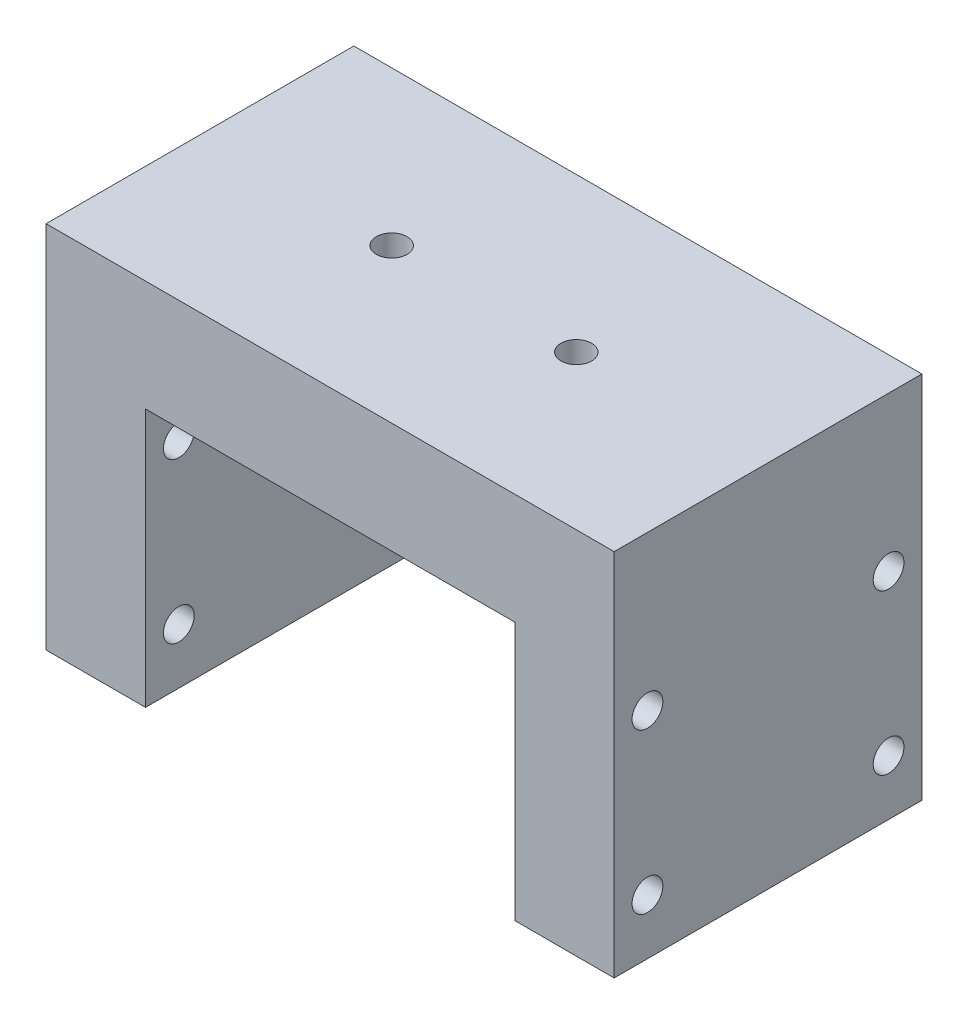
ISO-10303-21;
HEADER;
FILE_DESCRIPTION(('STEP AP214'),'2;1');
FILE_NAME('part.step','',(''),(''),'','','');
FILE_SCHEMA(('AUTOMOTIVE_DESIGN { 1 0 10303 214 1 1 1 1 }'));
ENDSEC;
DATA;
#1=APPLICATION_CONTEXT('core data for automotive mechanical design processes');
#2=APPLICATION_PROTOCOL_DEFINITION('international standard','automotive_design',2000,#1);
#3=PRODUCT_CONTEXT('',#1,'mechanical');
#4=PRODUCT('Part','Part','',(#3));
#5=PRODUCT_RELATED_PRODUCT_CATEGORY('part','',(#4));
#6=PRODUCT_DEFINITION_FORMATION('','',#4);
#7=PRODUCT_DEFINITION_CONTEXT('part definition',#1,'design');
#8=PRODUCT_DEFINITION('design','',#6,#7);
#9=PRODUCT_DEFINITION_SHAPE('','',#8);
#10=(LENGTH_UNIT() NAMED_UNIT(*) SI_UNIT(.MILLI.,.METRE.));
#11=(NAMED_UNIT(*) PLANE_ANGLE_UNIT() SI_UNIT($,.RADIAN.));
#12=(NAMED_UNIT(*) SI_UNIT($,.STERADIAN.) SOLID_ANGLE_UNIT());
#13=UNCERTAINTY_MEASURE_WITH_UNIT(LENGTH_MEASURE(1.E-05),#10,'distance_accuracy_value','');
#14=(GEOMETRIC_REPRESENTATION_CONTEXT(3) GLOBAL_UNCERTAINTY_ASSIGNED_CONTEXT((#13)) GLOBAL_UNIT_ASSIGNED_CONTEXT((#10,
#11,#12)) REPRESENTATION_CONTEXT('',''));
#15=CARTESIAN_POINT('',(0.,0.,0.));
#16=DIRECTION('',(0.,0.,1.));
#17=DIRECTION('',(1.,0.,0.));
#18=AXIS2_PLACEMENT_3D('',#15,#16,#17);
#19=CARTESIAN_POINT('',(-15.,-21.,12.5));
#20=DIRECTION('',(0.,1.,0.));
#21=DIRECTION('',(0.,0.,1.));
#22=AXIS2_PLACEMENT_3D('',#19,#20,#21);
#23=PLANE('',#22);
#24=DIRECTION('',(1.,0.,0.));
#25=VECTOR('',#24,1.);
#26=CARTESIAN_POINT('',(-15.,-21.,-12.5));
#27=LINE('',#26,#25);
#28=CARTESIAN_POINT('',(-23.075,-21.,-12.5));
#29=VERTEX_POINT('',#28);
#30=CARTESIAN_POINT('',(-15.,-21.,-12.5));
#31=VERTEX_POINT('',#30);
#32=EDGE_CURVE('E142',#29,#31,#27,.T.);
#33=ORIENTED_EDGE('',*,*,#32,.T.);
#34=DIRECTION('',(0.,0.,-1.));
#35=VECTOR('',#34,1.);
#36=CARTESIAN_POINT('',(-15.,-21.,12.5));
#37=LINE('',#36,#35);
#38=CARTESIAN_POINT('',(-15.,-21.,12.5));
#39=VERTEX_POINT('',#38);
#40=EDGE_CURVE('E11',#39,#31,#37,.T.);
#41=ORIENTED_EDGE('',*,*,#40,.F.);
#42=DIRECTION('',(1.,0.,0.));
#43=VECTOR('',#42,1.);
#44=CARTESIAN_POINT('',(-15.,-21.,12.5));
#45=LINE('',#44,#43);
#46=CARTESIAN_POINT('',(-23.075,-21.,12.5));
#47=VERTEX_POINT('',#46);
#48=EDGE_CURVE('E157',#47,#39,#45,.T.);
#49=ORIENTED_EDGE('',*,*,#48,.F.);
#50=DIRECTION('',(0.,0.,-1.));
#51=VECTOR('',#50,1.);
#52=CARTESIAN_POINT('',(-23.075,-21.,12.5));
#53=LINE('',#52,#51);
#54=EDGE_CURVE('E138',#47,#29,#53,.T.);
#55=ORIENTED_EDGE('',*,*,#54,.T.);
#56=EDGE_LOOP('',(#33,#41,#49,#55));
#57=FACE_BOUND('',#56,.T.);
#58=ADVANCED_FACE('F45',(#57),#23,.F.);
#59=CARTESIAN_POINT('',(-15.,0.,12.5));
#60=DIRECTION('',(-1.,0.,0.));
#61=DIRECTION('',(0.,-1.,0.));
#62=AXIS2_PLACEMENT_3D('',#59,#60,#61);
#63=PLANE('',#62);
#64=CARTESIAN_POINT('',(-15.,-3.53,-9.795));
#65=DIRECTION('',(-1.,0.,0.));
#66=DIRECTION('',(0.,-1.,0.));
#67=AXIS2_PLACEMENT_3D('',#64,#65,#66);
#68=CIRCLE('',#67,1.24999999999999);
#69=CARTESIAN_POINT('',(-15.,-4.77999999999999,-9.795));
#70=VERTEX_POINT('',#69);
#71=EDGE_CURVE('E238',#70,#70,#68,.T.);
#72=ORIENTED_EDGE('',*,*,#71,.T.);
#73=EDGE_LOOP('',(#72));
#74=FACE_BOUND('',#73,.T.);
#75=CARTESIAN_POINT('',(-15.,-16.5,9.795));
#76=DIRECTION('',(-1.,0.,0.));
#77=DIRECTION('',(0.,-1.,0.));
#78=AXIS2_PLACEMENT_3D('',#75,#76,#77);
#79=CIRCLE('',#78,1.24999999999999);
#80=CARTESIAN_POINT('',(-15.,-17.75,9.795));
#81=VERTEX_POINT('',#80);
#82=EDGE_CURVE('E226',#81,#81,#79,.T.);
#83=ORIENTED_EDGE('',*,*,#82,.T.);
#84=EDGE_LOOP('',(#83));
#85=FACE_BOUND('',#84,.T.);
#86=CARTESIAN_POINT('',(-15.,-16.5,-9.795));
#87=DIRECTION('',(-1.,0.,0.));
#88=DIRECTION('',(0.,-1.,0.));
#89=AXIS2_PLACEMENT_3D('',#86,#87,#88);
#90=CIRCLE('',#89,1.24999999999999);
#91=CARTESIAN_POINT('',(-15.,-17.75,-9.795));
#92=VERTEX_POINT('',#91);
#93=EDGE_CURVE('E214',#92,#92,#90,.T.);
#94=ORIENTED_EDGE('',*,*,#93,.T.);
#95=EDGE_LOOP('',(#94));
#96=FACE_BOUND('',#95,.T.);
#97=CARTESIAN_POINT('',(-15.,-3.53,9.795));
#98=DIRECTION('',(-1.,0.,0.));
#99=DIRECTION('',(0.,-1.,0.));
#100=AXIS2_PLACEMENT_3D('',#97,#98,#99);
#101=CIRCLE('',#100,1.24999999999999);
#102=CARTESIAN_POINT('',(-15.,-4.77999999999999,9.795));
#103=VERTEX_POINT('',#102);
#104=EDGE_CURVE('E205',#103,#103,#101,.T.);
#105=ORIENTED_EDGE('',*,*,#104,.T.);
#106=EDGE_LOOP('',(#105));
#107=FACE_BOUND('',#106,.T.);
#108=DIRECTION('',(0.,1.,0.));
#109=VECTOR('',#108,1.);
#110=CARTESIAN_POINT('',(-15.,0.,-12.5));
#111=LINE('',#110,#109);
#112=CARTESIAN_POINT('',(-15.,0.,-12.5));
#113=VERTEX_POINT('',#112);
#114=EDGE_CURVE('E145',#31,#113,#111,.T.);
#115=ORIENTED_EDGE('',*,*,#114,.T.);
#116=DIRECTION('',(0.,0.,-1.));
#117=VECTOR('',#116,1.);
#118=CARTESIAN_POINT('',(-15.,0.,12.5));
#119=LINE('',#118,#117);
#120=CARTESIAN_POINT('',(-15.,0.,12.5));
#121=VERTEX_POINT('',#120);
#122=EDGE_CURVE('E54',#121,#113,#119,.T.);
#123=ORIENTED_EDGE('',*,*,#122,.F.);
#124=DIRECTION('',(0.,1.,0.));
#125=VECTOR('',#124,1.);
#126=CARTESIAN_POINT('',(-15.,0.,12.5));
#127=LINE('',#126,#125);
#128=EDGE_CURVE('E105',#39,#121,#127,.T.);
#129=ORIENTED_EDGE('',*,*,#128,.F.);
#130=ORIENTED_EDGE('',*,*,#40,.T.);
#131=EDGE_LOOP('',(#115,#123,#129,#130));
#132=FACE_BOUND('',#131,.T.);
#133=ADVANCED_FACE('F269',(#74,#85,#96,#107,#132),#63,.F.);
#134=CARTESIAN_POINT('',(15.,0.,12.5));
#135=DIRECTION('',(0.,1.,0.));
#136=DIRECTION('',(-1.,0.,0.));
#137=AXIS2_PLACEMENT_3D('',#134,#135,#136);
#138=PLANE('',#137);
#139=CARTESIAN_POINT('',(-7.5,0.,0.));
#140=DIRECTION('',(0.,1.,0.));
#141=DIRECTION('',(-1.,0.,0.));
#142=AXIS2_PLACEMENT_3D('',#139,#140,#141);
#143=CIRCLE('',#142,1.25);
#144=CARTESIAN_POINT('',(-8.75,0.,0.));
#145=VERTEX_POINT('',#144);
#146=EDGE_CURVE('E196',#145,#145,#143,.T.);
#147=ORIENTED_EDGE('',*,*,#146,.T.);
#148=EDGE_LOOP('',(#147));
#149=FACE_BOUND('',#148,.T.);
#150=CARTESIAN_POINT('',(7.5,0.,0.));
#151=DIRECTION('',(0.,1.,0.));
#152=DIRECTION('',(-1.,0.,0.));
#153=AXIS2_PLACEMENT_3D('',#150,#151,#152);
#154=CIRCLE('',#153,1.25);
#155=CARTESIAN_POINT('',(6.25,0.,0.));
#156=VERTEX_POINT('',#155);
#157=EDGE_CURVE('E146',#156,#156,#154,.T.);
#158=ORIENTED_EDGE('',*,*,#157,.T.);
#159=EDGE_LOOP('',(#158));
#160=FACE_BOUND('',#159,.T.);
#161=DIRECTION('',(1.,0.,0.));
#162=VECTOR('',#161,1.);
#163=CARTESIAN_POINT('',(15.,0.,-12.5));
#164=LINE('',#163,#162);
#165=CARTESIAN_POINT('',(15.,0.,-12.5));
#166=VERTEX_POINT('',#165);
#167=EDGE_CURVE('E148',#113,#166,#164,.T.);
#168=ORIENTED_EDGE('',*,*,#167,.T.);
#169=DIRECTION('',(0.,0.,-1.));
#170=VECTOR('',#169,1.);
#171=CARTESIAN_POINT('',(15.,0.,12.5));
#172=LINE('',#171,#170);
#173=CARTESIAN_POINT('',(15.,0.,12.5));
#174=VERTEX_POINT('',#173);
#175=EDGE_CURVE('E164',#174,#166,#172,.T.);
#176=ORIENTED_EDGE('',*,*,#175,.F.);
#177=DIRECTION('',(1.,0.,0.));
#178=VECTOR('',#177,1.);
#179=CARTESIAN_POINT('',(15.,0.,12.5));
#180=LINE('',#179,#178);
#181=EDGE_CURVE('E173',#121,#174,#180,.T.);
#182=ORIENTED_EDGE('',*,*,#181,.F.);
#183=ORIENTED_EDGE('',*,*,#122,.T.);
#184=EDGE_LOOP('',(#168,#176,#182,#183));
#185=FACE_BOUND('',#184,.T.);
#186=ADVANCED_FACE('F171',(#149,#160,#185),#138,.F.);
#187=CARTESIAN_POINT('',(15.,-21.,12.5));
#188=DIRECTION('',(1.,0.,0.));
#189=DIRECTION('',(0.,1.,0.));
#190=AXIS2_PLACEMENT_3D('',#187,#188,#189);
#191=PLANE('',#190);
#192=CARTESIAN_POINT('',(15.,-3.53,-9.795));
#193=DIRECTION('',(1.,0.,0.));
#194=DIRECTION('',(0.,1.,0.));
#195=AXIS2_PLACEMENT_3D('',#192,#193,#194);
#196=CIRCLE('',#195,1.24999999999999);
#197=CARTESIAN_POINT('',(15.,-2.28000000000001,-9.795));
#198=VERTEX_POINT('',#197);
#199=EDGE_CURVE('E235',#198,#198,#196,.T.);
#200=ORIENTED_EDGE('',*,*,#199,.T.);
#201=EDGE_LOOP('',(#200));
#202=FACE_BOUND('',#201,.T.);
#203=CARTESIAN_POINT('',(15.,-16.5,9.795));
#204=DIRECTION('',(1.,0.,0.));
#205=DIRECTION('',(0.,1.,0.));
#206=AXIS2_PLACEMENT_3D('',#203,#204,#205);
#207=CIRCLE('',#206,1.24999999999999);
#208=CARTESIAN_POINT('',(15.,-15.25,9.795));
#209=VERTEX_POINT('',#208);
#210=EDGE_CURVE('E48',#209,#209,#207,.T.);
#211=ORIENTED_EDGE('',*,*,#210,.T.);
#212=EDGE_LOOP('',(#211));
#213=FACE_BOUND('',#212,.T.);
#214=CARTESIAN_POINT('',(15.,-16.5,-9.795));
#215=DIRECTION('',(1.,0.,0.));
#216=DIRECTION('',(0.,1.,0.));
#217=AXIS2_PLACEMENT_3D('',#214,#215,#216);
#218=CIRCLE('',#217,1.24999999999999);
#219=CARTESIAN_POINT('',(15.,-15.25,-9.795));
#220=VERTEX_POINT('',#219);
#221=EDGE_CURVE('E217',#220,#220,#218,.T.);
#222=ORIENTED_EDGE('',*,*,#221,.T.);
#223=EDGE_LOOP('',(#222));
#224=FACE_BOUND('',#223,.T.);
#225=CARTESIAN_POINT('',(15.,-3.53,9.795));
#226=DIRECTION('',(1.,0.,0.));
#227=DIRECTION('',(0.,1.,0.));
#228=AXIS2_PLACEMENT_3D('',#225,#226,#227);
#229=CIRCLE('',#228,1.24999999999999);
#230=CARTESIAN_POINT('',(15.,-2.28000000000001,9.795));
#231=VERTEX_POINT('',#230);
#232=EDGE_CURVE('E202',#231,#231,#229,.T.);
#233=ORIENTED_EDGE('',*,*,#232,.T.);
#234=EDGE_LOOP('',(#233));
#235=FACE_BOUND('',#234,.T.);
#236=DIRECTION('',(0.,-1.,0.));
#237=VECTOR('',#236,1.);
#238=CARTESIAN_POINT('',(15.,-21.,-12.5));
#239=LINE('',#238,#237);
#240=CARTESIAN_POINT('',(15.,-21.,-12.5));
#241=VERTEX_POINT('',#240);
#242=EDGE_CURVE('E150',#166,#241,#239,.T.);
#243=ORIENTED_EDGE('',*,*,#242,.T.);
#244=DIRECTION('',(0.,0.,-1.));
#245=VECTOR('',#244,1.);
#246=CARTESIAN_POINT('',(15.,-21.,12.5));
#247=LINE('',#246,#245);
#248=CARTESIAN_POINT('',(15.,-21.,12.5));
#249=VERTEX_POINT('',#248);
#250=EDGE_CURVE('E161',#249,#241,#247,.T.);
#251=ORIENTED_EDGE('',*,*,#250,.F.);
#252=DIRECTION('',(0.,-1.,0.));
#253=VECTOR('',#252,1.);
#254=CARTESIAN_POINT('',(15.,-21.,12.5));
#255=LINE('',#254,#253);
#256=EDGE_CURVE('E185',#174,#249,#255,.T.);
#257=ORIENTED_EDGE('',*,*,#256,.F.);
#258=ORIENTED_EDGE('',*,*,#175,.T.);
#259=EDGE_LOOP('',(#243,#251,#257,#258));
#260=FACE_BOUND('',#259,.T.);
#261=ADVANCED_FACE('F181',(#202,#213,#224,#235,#260),#191,.F.);
#262=CARTESIAN_POINT('',(23.075,-21.,12.5));
#263=DIRECTION('',(0.,1.,0.));
#264=DIRECTION('',(-1.,0.,0.));
#265=AXIS2_PLACEMENT_3D('',#262,#263,#264);
#266=PLANE('',#265);
#267=DIRECTION('',(1.,0.,0.));
#268=VECTOR('',#267,1.);
#269=CARTESIAN_POINT('',(23.075,-21.,-12.5));
#270=LINE('',#269,#268);
#271=CARTESIAN_POINT('',(23.075,-21.,-12.5));
#272=VERTEX_POINT('',#271);
#273=EDGE_CURVE('E152',#241,#272,#270,.T.);
#274=ORIENTED_EDGE('',*,*,#273,.T.);
#275=DIRECTION('',(0.,0.,-1.));
#276=VECTOR('',#275,1.);
#277=CARTESIAN_POINT('',(23.075,-21.,12.5));
#278=LINE('',#277,#276);
#279=CARTESIAN_POINT('',(23.075,-21.,12.5));
#280=VERTEX_POINT('',#279);
#281=EDGE_CURVE('E133',#280,#272,#278,.T.);
#282=ORIENTED_EDGE('',*,*,#281,.F.);
#283=DIRECTION('',(1.,0.,0.));
#284=VECTOR('',#283,1.);
#285=CARTESIAN_POINT('',(23.075,-21.,12.5));
#286=LINE('',#285,#284);
#287=EDGE_CURVE('E124',#249,#280,#286,.T.);
#288=ORIENTED_EDGE('',*,*,#287,.F.);
#289=ORIENTED_EDGE('',*,*,#250,.T.);
#290=EDGE_LOOP('',(#274,#282,#288,#289));
#291=FACE_BOUND('',#290,.T.);
#292=ADVANCED_FACE('F184',(#291),#266,.F.);
#293=CARTESIAN_POINT('',(23.075,9.00000000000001,12.5));
#294=DIRECTION('',(-1.,0.,0.));
#295=DIRECTION('',(0.,-1.,0.));
#296=AXIS2_PLACEMENT_3D('',#293,#294,#295);
#297=PLANE('',#296);
#298=CARTESIAN_POINT('',(23.075,-3.53,-9.795));
#299=DIRECTION('',(-1.,0.,0.));
#300=DIRECTION('',(0.,0.,1.));
#301=AXIS2_PLACEMENT_3D('',#298,#299,#300);
#302=CIRCLE('',#301,1.24999999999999);
#303=CARTESIAN_POINT('',(23.075,-3.53,-8.54500000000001));
#304=VERTEX_POINT('',#303);
#305=EDGE_CURVE('E241',#304,#304,#302,.T.);
#306=ORIENTED_EDGE('',*,*,#305,.T.);
#307=EDGE_LOOP('',(#306));
#308=FACE_BOUND('',#307,.T.);
#309=CARTESIAN_POINT('',(23.075,-16.5,9.795));
#310=DIRECTION('',(-1.,0.,0.));
#311=DIRECTION('',(0.,0.,1.));
#312=AXIS2_PLACEMENT_3D('',#309,#310,#311);
#313=CIRCLE('',#312,1.24999999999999);
#314=CARTESIAN_POINT('',(23.075,-16.5,11.045));
#315=VERTEX_POINT('',#314);
#316=EDGE_CURVE('E229',#315,#315,#313,.T.);
#317=ORIENTED_EDGE('',*,*,#316,.T.);
#318=EDGE_LOOP('',(#317));
#319=FACE_BOUND('',#318,.T.);
#320=CARTESIAN_POINT('',(23.075,-16.5,-9.795));
#321=DIRECTION('',(-1.,0.,0.));
#322=DIRECTION('',(0.,0.,1.));
#323=AXIS2_PLACEMENT_3D('',#320,#321,#322);
#324=CIRCLE('',#323,1.24999999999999);
#325=CARTESIAN_POINT('',(23.075,-16.5,-8.54500000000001));
#326=VERTEX_POINT('',#325);
#327=EDGE_CURVE('E220',#326,#326,#324,.T.);
#328=ORIENTED_EDGE('',*,*,#327,.T.);
#329=EDGE_LOOP('',(#328));
#330=FACE_BOUND('',#329,.T.);
#331=CARTESIAN_POINT('',(23.075,-3.53,9.795));
#332=DIRECTION('',(-1.,0.,0.));
#333=DIRECTION('',(0.,0.,1.));
#334=AXIS2_PLACEMENT_3D('',#331,#332,#333);
#335=CIRCLE('',#334,1.24999999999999);
#336=CARTESIAN_POINT('',(23.075,-3.53,11.045));
#337=VERTEX_POINT('',#336);
#338=EDGE_CURVE('E208',#337,#337,#335,.T.);
#339=ORIENTED_EDGE('',*,*,#338,.T.);
#340=EDGE_LOOP('',(#339));
#341=FACE_BOUND('',#340,.T.);
#342=DIRECTION('',(0.,1.,0.));
#343=VECTOR('',#342,1.);
#344=CARTESIAN_POINT('',(23.075,9.00000000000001,-12.5));
#345=LINE('',#344,#343);
#346=CARTESIAN_POINT('',(23.075,9.00000000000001,-12.5));
#347=VERTEX_POINT('',#346);
#348=EDGE_CURVE('E132',#272,#347,#345,.T.);
#349=ORIENTED_EDGE('',*,*,#348,.T.);
#350=DIRECTION('',(0.,0.,-1.));
#351=VECTOR('',#350,1.);
#352=CARTESIAN_POINT('',(23.075,9.00000000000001,12.5));
#353=LINE('',#352,#351);
#354=CARTESIAN_POINT('',(23.075,9.00000000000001,12.5));
#355=VERTEX_POINT('',#354);
#356=EDGE_CURVE('E129',#355,#347,#353,.T.);
#357=ORIENTED_EDGE('',*,*,#356,.F.);
#358=DIRECTION('',(0.,1.,0.));
#359=VECTOR('',#358,1.);
#360=CARTESIAN_POINT('',(23.075,9.00000000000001,12.5));
#361=LINE('',#360,#359);
#362=EDGE_CURVE('E118',#280,#355,#361,.T.);
#363=ORIENTED_EDGE('',*,*,#362,.F.);
#364=ORIENTED_EDGE('',*,*,#281,.T.);
#365=EDGE_LOOP('',(#349,#357,#363,#364));
#366=FACE_BOUND('',#365,.T.);
#367=ADVANCED_FACE('F130',(#308,#319,#330,#341,#366),#297,.F.);
#368=CARTESIAN_POINT('',(-23.075,8.99999999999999,12.5));
#369=DIRECTION('',(0.,-1.,0.));
#370=DIRECTION('',(1.,0.,0.));
#371=AXIS2_PLACEMENT_3D('',#368,#369,#370);
#372=PLANE('',#371);
#373=CARTESIAN_POINT('',(-7.5,9.,0.));
#374=DIRECTION('',(0.,1.,0.));
#375=DIRECTION('',(0.,0.,1.));
#376=AXIS2_PLACEMENT_3D('',#373,#374,#375);
#377=CIRCLE('',#376,1.25);
#378=CARTESIAN_POINT('',(-7.5,9.,1.25));
#379=VERTEX_POINT('',#378);
#380=EDGE_CURVE('E199',#379,#379,#377,.T.);
#381=ORIENTED_EDGE('',*,*,#380,.F.);
#382=EDGE_LOOP('',(#381));
#383=FACE_BOUND('',#382,.T.);
#384=CARTESIAN_POINT('',(7.5,9.,0.));
#385=DIRECTION('',(0.,1.,0.));
#386=DIRECTION('',(0.,0.,1.));
#387=AXIS2_PLACEMENT_3D('',#384,#385,#386);
#388=CIRCLE('',#387,1.25);
#389=CARTESIAN_POINT('',(7.5,9.,1.25));
#390=VERTEX_POINT('',#389);
#391=EDGE_CURVE('E193',#390,#390,#388,.T.);
#392=ORIENTED_EDGE('',*,*,#391,.F.);
#393=EDGE_LOOP('',(#392));
#394=FACE_BOUND('',#393,.T.);
#395=DIRECTION('',(-1.,0.,0.));
#396=VECTOR('',#395,1.);
#397=CARTESIAN_POINT('',(-23.075,8.99999999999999,-12.5));
#398=LINE('',#397,#396);
#399=CARTESIAN_POINT('',(-23.075,8.99999999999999,-12.5));
#400=VERTEX_POINT('',#399);
#401=EDGE_CURVE('E91',#347,#400,#398,.T.);
#402=ORIENTED_EDGE('',*,*,#401,.T.);
#403=DIRECTION('',(0.,0.,-1.));
#404=VECTOR('',#403,1.);
#405=CARTESIAN_POINT('',(-23.075,8.99999999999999,12.5));
#406=LINE('',#405,#404);
#407=CARTESIAN_POINT('',(-23.075,8.99999999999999,12.5));
#408=VERTEX_POINT('',#407);
#409=EDGE_CURVE('E134',#408,#400,#406,.T.);
#410=ORIENTED_EDGE('',*,*,#409,.F.);
#411=DIRECTION('',(-1.,0.,0.));
#412=VECTOR('',#411,1.);
#413=CARTESIAN_POINT('',(-23.075,8.99999999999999,12.5));
#414=LINE('',#413,#412);
#415=EDGE_CURVE('E122',#355,#408,#414,.T.);
#416=ORIENTED_EDGE('',*,*,#415,.F.);
#417=ORIENTED_EDGE('',*,*,#356,.T.);
#418=EDGE_LOOP('',(#402,#410,#416,#417));
#419=FACE_BOUND('',#418,.T.);
#420=ADVANCED_FACE('F136',(#383,#394,#419),#372,.F.);
#421=CARTESIAN_POINT('',(-23.075,-21.,12.5));
#422=DIRECTION('',(1.,0.,0.));
#423=DIRECTION('',(0.,1.,0.));
#424=AXIS2_PLACEMENT_3D('',#421,#422,#423);
#425=PLANE('',#424);
#426=CARTESIAN_POINT('',(-23.075,-3.53,-9.795));
#427=DIRECTION('',(-1.,0.,0.));
#428=DIRECTION('',(0.,0.,1.));
#429=AXIS2_PLACEMENT_3D('',#426,#427,#428);
#430=CIRCLE('',#429,1.24999999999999);
#431=CARTESIAN_POINT('',(-23.075,-3.53,-8.54500000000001));
#432=VERTEX_POINT('',#431);
#433=EDGE_CURVE('E244',#432,#432,#430,.T.);
#434=ORIENTED_EDGE('',*,*,#433,.F.);
#435=EDGE_LOOP('',(#434));
#436=FACE_BOUND('',#435,.T.);
#437=CARTESIAN_POINT('',(-23.075,-16.5,9.795));
#438=DIRECTION('',(-1.,0.,0.));
#439=DIRECTION('',(0.,0.,1.));
#440=AXIS2_PLACEMENT_3D('',#437,#438,#439);
#441=CIRCLE('',#440,1.24999999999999);
#442=CARTESIAN_POINT('',(-23.075,-16.5,11.045));
#443=VERTEX_POINT('',#442);
#444=EDGE_CURVE('E232',#443,#443,#441,.T.);
#445=ORIENTED_EDGE('',*,*,#444,.F.);
#446=EDGE_LOOP('',(#445));
#447=FACE_BOUND('',#446,.T.);
#448=CARTESIAN_POINT('',(-23.075,-16.5,-9.795));
#449=DIRECTION('',(-1.,0.,0.));
#450=DIRECTION('',(0.,0.,1.));
#451=AXIS2_PLACEMENT_3D('',#448,#449,#450);
#452=CIRCLE('',#451,1.24999999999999);
#453=CARTESIAN_POINT('',(-23.075,-16.5,-8.54500000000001));
#454=VERTEX_POINT('',#453);
#455=EDGE_CURVE('E223',#454,#454,#452,.T.);
#456=ORIENTED_EDGE('',*,*,#455,.F.);
#457=EDGE_LOOP('',(#456));
#458=FACE_BOUND('',#457,.T.);
#459=CARTESIAN_POINT('',(-23.075,-3.53,9.795));
#460=DIRECTION('',(-1.,0.,0.));
#461=DIRECTION('',(0.,0.,1.));
#462=AXIS2_PLACEMENT_3D('',#459,#460,#461);
#463=CIRCLE('',#462,1.24999999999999);
#464=CARTESIAN_POINT('',(-23.075,-3.53,11.045));
#465=VERTEX_POINT('',#464);
#466=EDGE_CURVE('E211',#465,#465,#463,.T.);
#467=ORIENTED_EDGE('',*,*,#466,.F.);
#468=EDGE_LOOP('',(#467));
#469=FACE_BOUND('',#468,.T.);
#470=DIRECTION('',(0.,-1.,0.));
#471=VECTOR('',#470,1.);
#472=CARTESIAN_POINT('',(-23.075,-21.,-12.5));
#473=LINE('',#472,#471);
#474=EDGE_CURVE('E97',#400,#29,#473,.T.);
#475=ORIENTED_EDGE('',*,*,#474,.T.);
#476=ORIENTED_EDGE('',*,*,#54,.F.);
#477=DIRECTION('',(0.,-1.,0.));
#478=VECTOR('',#477,1.);
#479=CARTESIAN_POINT('',(-23.075,-21.,12.5));
#480=LINE('',#479,#478);
#481=EDGE_CURVE('E62',#408,#47,#480,.T.);
#482=ORIENTED_EDGE('',*,*,#481,.F.);
#483=ORIENTED_EDGE('',*,*,#409,.T.);
#484=EDGE_LOOP('',(#475,#476,#482,#483));
#485=FACE_BOUND('',#484,.T.);
#486=ADVANCED_FACE('F251',(#436,#447,#458,#469,#485),#425,.F.);
#487=CARTESIAN_POINT('',(0.,0.,12.5));
#488=DIRECTION('',(0.,0.,-1.));
#489=DIRECTION('',(-1.,0.,0.));
#490=AXIS2_PLACEMENT_3D('',#487,#488,#489);
#491=PLANE('',#490);
#492=ORIENTED_EDGE('',*,*,#48,.T.);
#493=ORIENTED_EDGE('',*,*,#128,.T.);
#494=ORIENTED_EDGE('',*,*,#181,.T.);
#495=ORIENTED_EDGE('',*,*,#256,.T.);
#496=ORIENTED_EDGE('',*,*,#287,.T.);
#497=ORIENTED_EDGE('',*,*,#362,.T.);
#498=ORIENTED_EDGE('',*,*,#415,.T.);
#499=ORIENTED_EDGE('',*,*,#481,.T.);
#500=EDGE_LOOP('',(#492,#493,#494,#495,#496,#497,#498,#499));
#501=FACE_BOUND('',#500,.T.);
#502=ADVANCED_FACE('F120',(#501),#491,.F.);
#503=CARTESIAN_POINT('',(0.,0.,-12.5));
#504=DIRECTION('',(0.,0.,-1.));
#505=DIRECTION('',(-1.,0.,0.));
#506=AXIS2_PLACEMENT_3D('',#503,#504,#505);
#507=PLANE('',#506);
#508=ORIENTED_EDGE('',*,*,#32,.F.);
#509=ORIENTED_EDGE('',*,*,#474,.F.);
#510=ORIENTED_EDGE('',*,*,#401,.F.);
#511=ORIENTED_EDGE('',*,*,#348,.F.);
#512=ORIENTED_EDGE('',*,*,#273,.F.);
#513=ORIENTED_EDGE('',*,*,#242,.F.);
#514=ORIENTED_EDGE('',*,*,#167,.F.);
#515=ORIENTED_EDGE('',*,*,#114,.F.);
#516=EDGE_LOOP('',(#508,#509,#510,#511,#512,#513,#514,#515));
#517=FACE_BOUND('',#516,.T.);
#518=ADVANCED_FACE('F177',(#517),#507,.T.);
#519=CARTESIAN_POINT('',(7.5,9.,0.));
#520=DIRECTION('',(0.,1.,0.));
#521=DIRECTION('',(0.,0.,1.));
#522=AXIS2_PLACEMENT_3D('',#519,#520,#521);
#523=CYLINDRICAL_SURFACE('',#522,1.25);
#524=ORIENTED_EDGE('',*,*,#391,.T.);
#525=EDGE_LOOP('',(#524));
#526=FACE_BOUND('',#525,.T.);
#527=ORIENTED_EDGE('',*,*,#157,.F.);
#528=EDGE_LOOP('',(#527));
#529=FACE_BOUND('',#528,.T.);
#530=ADVANCED_FACE('F336',(#526,#529),#523,.F.);
#531=CARTESIAN_POINT('',(-7.5,9.,0.));
#532=DIRECTION('',(0.,1.,0.));
#533=DIRECTION('',(0.,0.,1.));
#534=AXIS2_PLACEMENT_3D('',#531,#532,#533);
#535=CYLINDRICAL_SURFACE('',#534,1.25);
#536=ORIENTED_EDGE('',*,*,#380,.T.);
#537=EDGE_LOOP('',(#536));
#538=FACE_BOUND('',#537,.T.);
#539=ORIENTED_EDGE('',*,*,#146,.F.);
#540=EDGE_LOOP('',(#539));
#541=FACE_BOUND('',#540,.T.);
#542=ADVANCED_FACE('F265',(#538,#541),#535,.F.);
#543=CARTESIAN_POINT('',(-23.075,-3.53,9.795));
#544=DIRECTION('',(-1.,0.,0.));
#545=DIRECTION('',(0.,0.,1.));
#546=AXIS2_PLACEMENT_3D('',#543,#544,#545);
#547=CYLINDRICAL_SURFACE('',#546,1.24999999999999);
#548=ORIENTED_EDGE('',*,*,#466,.T.);
#549=EDGE_LOOP('',(#548));
#550=FACE_BOUND('',#549,.T.);
#551=ORIENTED_EDGE('',*,*,#104,.F.);
#552=EDGE_LOOP('',(#551));
#553=FACE_BOUND('',#552,.T.);
#554=ADVANCED_FACE('F261',(#550,#553),#547,.F.);
#555=ORIENTED_EDGE('',*,*,#338,.F.);
#556=EDGE_LOOP('',(#555));
#557=FACE_BOUND('',#556,.T.);
#558=ORIENTED_EDGE('',*,*,#232,.F.);
#559=EDGE_LOOP('',(#558));
#560=FACE_BOUND('',#559,.T.);
#561=ADVANCED_FACE('F264',(#557,#560),#547,.F.);
#562=CARTESIAN_POINT('',(-23.075,-16.5,-9.795));
#563=DIRECTION('',(-1.,0.,0.));
#564=DIRECTION('',(0.,0.,1.));
#565=AXIS2_PLACEMENT_3D('',#562,#563,#564);
#566=CYLINDRICAL_SURFACE('',#565,1.24999999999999);
#567=ORIENTED_EDGE('',*,*,#327,.F.);
#568=EDGE_LOOP('',(#567));
#569=FACE_BOUND('',#568,.T.);
#570=ORIENTED_EDGE('',*,*,#221,.F.);
#571=EDGE_LOOP('',(#570));
#572=FACE_BOUND('',#571,.T.);
#573=ADVANCED_FACE('F359',(#569,#572),#566,.F.);
#574=ORIENTED_EDGE('',*,*,#455,.T.);
#575=EDGE_LOOP('',(#574));
#576=FACE_BOUND('',#575,.T.);
#577=ORIENTED_EDGE('',*,*,#93,.F.);
#578=EDGE_LOOP('',(#577));
#579=FACE_BOUND('',#578,.T.);
#580=ADVANCED_FACE('F366',(#576,#579),#566,.F.);
#581=CARTESIAN_POINT('',(-23.075,-16.5,9.795));
#582=DIRECTION('',(-1.,0.,0.));
#583=DIRECTION('',(0.,0.,1.));
#584=AXIS2_PLACEMENT_3D('',#581,#582,#583);
#585=CYLINDRICAL_SURFACE('',#584,1.24999999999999);
#586=ORIENTED_EDGE('',*,*,#316,.F.);
#587=EDGE_LOOP('',(#586));
#588=FACE_BOUND('',#587,.T.);
#589=ORIENTED_EDGE('',*,*,#210,.F.);
#590=EDGE_LOOP('',(#589));
#591=FACE_BOUND('',#590,.T.);
#592=ADVANCED_FACE('F374',(#588,#591),#585,.F.);
#593=ORIENTED_EDGE('',*,*,#444,.T.);
#594=EDGE_LOOP('',(#593));
#595=FACE_BOUND('',#594,.T.);
#596=ORIENTED_EDGE('',*,*,#82,.F.);
#597=EDGE_LOOP('',(#596));
#598=FACE_BOUND('',#597,.T.);
#599=ADVANCED_FACE('F381',(#595,#598),#585,.F.);
#600=CARTESIAN_POINT('',(-23.075,-3.53,-9.795));
#601=DIRECTION('',(-1.,0.,0.));
#602=DIRECTION('',(0.,0.,1.));
#603=AXIS2_PLACEMENT_3D('',#600,#601,#602);
#604=CYLINDRICAL_SURFACE('',#603,1.24999999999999);
#605=ORIENTED_EDGE('',*,*,#433,.T.);
#606=EDGE_LOOP('',(#605));
#607=FACE_BOUND('',#606,.T.);
#608=ORIENTED_EDGE('',*,*,#71,.F.);
#609=EDGE_LOOP('',(#608));
#610=FACE_BOUND('',#609,.T.);
#611=ADVANCED_FACE('F248',(#607,#610),#604,.F.);
#612=ORIENTED_EDGE('',*,*,#305,.F.);
#613=EDGE_LOOP('',(#612));
#614=FACE_BOUND('',#613,.T.);
#615=ORIENTED_EDGE('',*,*,#199,.F.);
#616=EDGE_LOOP('',(#615));
#617=FACE_BOUND('',#616,.T.);
#618=ADVANCED_FACE('F395',(#614,#617),#604,.F.);
#619=CLOSED_SHELL('',(#58,#133,#186,#261,#292,#367,#420,#486,#502,#518,#530,#542,#554,#561,#573,
#580,#592,#599,#611,#618));
#620=MANIFOLD_SOLID_BREP('B2',#619);
#621=ADVANCED_BREP_SHAPE_REPRESENTATION('',(#18,#620),#14);
#622=SHAPE_DEFINITION_REPRESENTATION(#9,#621);
ENDSEC;
END-ISO-10303-21;
